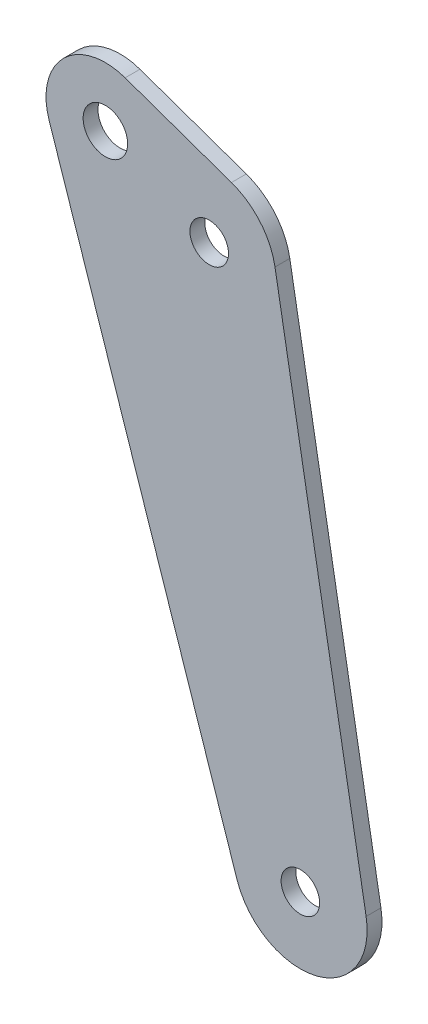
ISO-10303-21;
HEADER;
FILE_DESCRIPTION(('STEP AP214'),'2;1');
FILE_NAME('part.step','',(''),(''),'','','');
FILE_SCHEMA(('AUTOMOTIVE_DESIGN { 1 0 10303 214 1 1 1 1 }'));
ENDSEC;
DATA;
#1=APPLICATION_CONTEXT('core data for automotive mechanical design processes');
#2=APPLICATION_PROTOCOL_DEFINITION('international standard','automotive_design',2000,#1);
#3=PRODUCT_CONTEXT('',#1,'mechanical');
#4=PRODUCT('Part','Part','',(#3));
#5=PRODUCT_RELATED_PRODUCT_CATEGORY('part','',(#4));
#6=PRODUCT_DEFINITION_FORMATION('','',#4);
#7=PRODUCT_DEFINITION_CONTEXT('part definition',#1,'design');
#8=PRODUCT_DEFINITION('design','',#6,#7);
#9=PRODUCT_DEFINITION_SHAPE('','',#8);
#10=(LENGTH_UNIT() NAMED_UNIT(*) SI_UNIT(.MILLI.,.METRE.));
#11=(NAMED_UNIT(*) PLANE_ANGLE_UNIT() SI_UNIT($,.RADIAN.));
#12=(NAMED_UNIT(*) SI_UNIT($,.STERADIAN.) SOLID_ANGLE_UNIT());
#13=UNCERTAINTY_MEASURE_WITH_UNIT(LENGTH_MEASURE(1.E-05),#10,'distance_accuracy_value','');
#14=(GEOMETRIC_REPRESENTATION_CONTEXT(3) GLOBAL_UNCERTAINTY_ASSIGNED_CONTEXT((#13)) GLOBAL_UNIT_ASSIGNED_CONTEXT((#10,
#11,#12)) REPRESENTATION_CONTEXT('',''));
#15=CARTESIAN_POINT('',(0.,0.,0.));
#16=DIRECTION('',(0.,0.,1.));
#17=DIRECTION('',(1.,0.,0.));
#18=AXIS2_PLACEMENT_3D('',#15,#16,#17);
#19=CARTESIAN_POINT('',(-36.,-62.,6.2));
#20=DIRECTION('',(0.,0.,1.));
#21=DIRECTION('',(1.,0.,0.));
#22=AXIS2_PLACEMENT_3D('',#19,#20,#21);
#23=PLANE('',#22);
#24=CARTESIAN_POINT('',(-22.,-68.,6.2));
#25=DIRECTION('',(0.,0.,1.));
#26=DIRECTION('',(1.,0.,0.));
#27=AXIS2_PLACEMENT_3D('',#24,#25,#26);
#28=CIRCLE('',#27,2.60000000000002);
#29=CARTESIAN_POINT('',(-19.4,-68.,6.2));
#30=VERTEX_POINT('',#29);
#31=EDGE_CURVE('E187',#30,#30,#28,.T.);
#32=ORIENTED_EDGE('',*,*,#31,.F.);
#33=EDGE_LOOP('',(#32));
#34=FACE_BOUND('',#33,.T.);
#35=CARTESIAN_POINT('',(-36.,-62.,6.2));
#36=DIRECTION('',(0.,0.,1.));
#37=DIRECTION('',(1.,0.,0.));
#38=AXIS2_PLACEMENT_3D('',#35,#36,#37);
#39=CIRCLE('',#38,8.);
#40=CARTESIAN_POINT('',(-33.3382032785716,-54.4558076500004,6.2));
#41=VERTEX_POINT('',#40);
#42=CARTESIAN_POINT('',(-43.5892726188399,-64.5304033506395,6.2));
#43=VERTEX_POINT('',#42);
#44=EDGE_CURVE('E132',#41,#43,#39,.T.);
#45=ORIENTED_EDGE('',*,*,#44,.T.);
#46=DIRECTION('',(0.316300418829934,-0.948659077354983,0.));
#47=VECTOR('',#46,1.);
#48=CARTESIAN_POINT('',(-43.5892726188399,-64.5304033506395,6.2));
#49=LINE('',#48,#47);
#50=CARTESIAN_POINT('',(-18.2523231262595,-140.521852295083,6.2));
#51=VERTEX_POINT('',#50);
#52=EDGE_CURVE('E90',#43,#51,#49,.T.);
#53=ORIENTED_EDGE('',*,*,#52,.T.);
#54=CARTESIAN_POINT('',(-9.71439143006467,-137.675148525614,6.2));
#55=DIRECTION('',(0.,0.,1.));
#56=DIRECTION('',(1.,0.,0.));
#57=AXIS2_PLACEMENT_3D('',#54,#55,#56);
#58=CIRCLE('',#57,9.);
#59=CARTESIAN_POINT('',(-0.851121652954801,-136.112314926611,6.2));
#60=VERTEX_POINT('',#59);
#61=EDGE_CURVE('E103',#51,#60,#58,.T.);
#62=ORIENTED_EDGE('',*,*,#61,.T.);
#63=DIRECTION('',(-0.17364817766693,0.984807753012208,0.));
#64=VECTOR('',#63,1.);
#65=CARTESIAN_POINT('',(-0.851121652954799,-136.112314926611,6.2));
#66=LINE('',#65,#64);
#67=CARTESIAN_POINT('',(-13.1367302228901,-66.4371664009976,6.2));
#68=VERTEX_POINT('',#67);
#69=EDGE_CURVE('E97',#60,#68,#66,.T.);
#70=ORIENTED_EDGE('',*,*,#69,.T.);
#71=CARTESIAN_POINT('',(-22.,-68.,6.2));
#72=DIRECTION('',(0.,0.,1.));
#73=DIRECTION('',(1.,0.,0.));
#74=AXIS2_PLACEMENT_3D('',#71,#72,#73);
#75=CIRCLE('',#74,9.00000000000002);
#76=CARTESIAN_POINT('',(-19.005478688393,-59.5127836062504,6.2));
#77=VERTEX_POINT('',#76);
#78=EDGE_CURVE('E101',#68,#77,#75,.T.);
#79=ORIENTED_EDGE('',*,*,#78,.T.);
#80=DIRECTION('',(-0.943024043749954,0.332724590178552,0.));
#81=VECTOR('',#80,1.);
#82=CARTESIAN_POINT('',(-19.005478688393,-59.5127836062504,6.2));
#83=LINE('',#82,#81);
#84=EDGE_CURVE('E53',#77,#41,#83,.T.);
#85=ORIENTED_EDGE('',*,*,#84,.T.);
#86=EDGE_LOOP('',(#45,#53,#62,#70,#79,#85));
#87=FACE_BOUND('',#86,.T.);
#88=CARTESIAN_POINT('',(-36.,-62.,6.2));
#89=DIRECTION('',(0.,0.,1.));
#90=DIRECTION('',(1.,0.,0.));
#91=AXIS2_PLACEMENT_3D('',#88,#89,#90);
#92=CIRCLE('',#91,2.99999999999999);
#93=CARTESIAN_POINT('',(-33.,-62.,6.2));
#94=VERTEX_POINT('',#93);
#95=EDGE_CURVE('E125',#94,#94,#92,.T.);
#96=ORIENTED_EDGE('',*,*,#95,.F.);
#97=EDGE_LOOP('',(#96));
#98=FACE_BOUND('',#97,.T.);
#99=CARTESIAN_POINT('',(-9.71439143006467,-137.675148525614,6.2));
#100=DIRECTION('',(0.,0.,1.));
#101=DIRECTION('',(1.,0.,0.));
#102=AXIS2_PLACEMENT_3D('',#99,#100,#101);
#103=CIRCLE('',#102,2.6);
#104=CARTESIAN_POINT('',(-7.11439143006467,-137.675148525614,6.2));
#105=VERTEX_POINT('',#104);
#106=EDGE_CURVE('E178',#105,#105,#103,.T.);
#107=ORIENTED_EDGE('',*,*,#106,.F.);
#108=EDGE_LOOP('',(#107));
#109=FACE_BOUND('',#108,.T.);
#110=ADVANCED_FACE('F36',(#34,#87,#98,#109),#23,.T.);
#111=CARTESIAN_POINT('',(-36.,-62.,4.2));
#112=DIRECTION('',(0.,0.,1.));
#113=DIRECTION('',(1.,0.,0.));
#114=AXIS2_PLACEMENT_3D('',#111,#112,#113);
#115=PLANE('',#114);
#116=CARTESIAN_POINT('',(-36.,-62.,4.2));
#117=DIRECTION('',(0.,0.,1.));
#118=DIRECTION('',(1.,0.,0.));
#119=AXIS2_PLACEMENT_3D('',#116,#117,#118);
#120=CIRCLE('',#119,8.);
#121=CARTESIAN_POINT('',(-33.3382032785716,-54.4558076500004,4.2));
#122=VERTEX_POINT('',#121);
#123=CARTESIAN_POINT('',(-43.5892726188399,-64.5304033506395,4.2));
#124=VERTEX_POINT('',#123);
#125=EDGE_CURVE('E121',#122,#124,#120,.T.);
#126=ORIENTED_EDGE('',*,*,#125,.F.);
#127=DIRECTION('',(-0.943024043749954,0.332724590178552,0.));
#128=VECTOR('',#127,1.);
#129=CARTESIAN_POINT('',(-19.005478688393,-59.5127836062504,4.2));
#130=LINE('',#129,#128);
#131=CARTESIAN_POINT('',(-19.005478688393,-59.5127836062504,4.2));
#132=VERTEX_POINT('',#131);
#133=EDGE_CURVE('E82',#132,#122,#130,.T.);
#134=ORIENTED_EDGE('',*,*,#133,.F.);
#135=CARTESIAN_POINT('',(-22.,-68.,4.2));
#136=DIRECTION('',(0.,0.,1.));
#137=DIRECTION('',(1.,0.,0.));
#138=AXIS2_PLACEMENT_3D('',#135,#136,#137);
#139=CIRCLE('',#138,9.00000000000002);
#140=CARTESIAN_POINT('',(-13.1367302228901,-66.4371664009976,4.2));
#141=VERTEX_POINT('',#140);
#142=EDGE_CURVE('E76',#141,#132,#139,.T.);
#143=ORIENTED_EDGE('',*,*,#142,.F.);
#144=DIRECTION('',(-0.17364817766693,0.984807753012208,0.));
#145=VECTOR('',#144,1.);
#146=CARTESIAN_POINT('',(-0.851121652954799,-136.112314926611,4.2));
#147=LINE('',#146,#145);
#148=CARTESIAN_POINT('',(-0.851121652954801,-136.112314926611,4.2));
#149=VERTEX_POINT('',#148);
#150=EDGE_CURVE('E111',#149,#141,#147,.T.);
#151=ORIENTED_EDGE('',*,*,#150,.F.);
#152=CARTESIAN_POINT('',(-9.71439143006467,-137.675148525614,4.2));
#153=DIRECTION('',(0.,0.,1.));
#154=DIRECTION('',(1.,0.,0.));
#155=AXIS2_PLACEMENT_3D('',#152,#153,#154);
#156=CIRCLE('',#155,9.);
#157=CARTESIAN_POINT('',(-18.2523231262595,-140.521852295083,4.2));
#158=VERTEX_POINT('',#157);
#159=EDGE_CURVE('E127',#158,#149,#156,.T.);
#160=ORIENTED_EDGE('',*,*,#159,.F.);
#161=DIRECTION('',(0.316300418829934,-0.948659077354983,0.));
#162=VECTOR('',#161,1.);
#163=CARTESIAN_POINT('',(-43.5892726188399,-64.5304033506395,4.2));
#164=LINE('',#163,#162);
#165=EDGE_CURVE('E124',#124,#158,#164,.T.);
#166=ORIENTED_EDGE('',*,*,#165,.F.);
#167=EDGE_LOOP('',(#126,#134,#143,#151,#160,#166));
#168=FACE_BOUND('',#167,.T.);
#169=CARTESIAN_POINT('',(-36.,-62.,4.2));
#170=DIRECTION('',(0.,0.,1.));
#171=DIRECTION('',(1.,0.,0.));
#172=AXIS2_PLACEMENT_3D('',#169,#170,#171);
#173=CIRCLE('',#172,2.99999999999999);
#174=CARTESIAN_POINT('',(-33.,-62.,4.2));
#175=VERTEX_POINT('',#174);
#176=EDGE_CURVE('E190',#175,#175,#173,.T.);
#177=ORIENTED_EDGE('',*,*,#176,.T.);
#178=EDGE_LOOP('',(#177));
#179=FACE_BOUND('',#178,.T.);
#180=CARTESIAN_POINT('',(-22.,-68.,4.2));
#181=DIRECTION('',(0.,0.,1.));
#182=DIRECTION('',(1.,0.,0.));
#183=AXIS2_PLACEMENT_3D('',#180,#181,#182);
#184=CIRCLE('',#183,2.60000000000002);
#185=CARTESIAN_POINT('',(-19.4,-68.,4.2));
#186=VERTEX_POINT('',#185);
#187=EDGE_CURVE('E184',#186,#186,#184,.T.);
#188=ORIENTED_EDGE('',*,*,#187,.T.);
#189=EDGE_LOOP('',(#188));
#190=FACE_BOUND('',#189,.T.);
#191=CARTESIAN_POINT('',(-9.71439143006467,-137.675148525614,4.2));
#192=DIRECTION('',(0.,0.,1.));
#193=DIRECTION('',(1.,0.,0.));
#194=AXIS2_PLACEMENT_3D('',#191,#192,#193);
#195=CIRCLE('',#194,2.6);
#196=CARTESIAN_POINT('',(-7.11439143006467,-137.675148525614,4.2));
#197=VERTEX_POINT('',#196);
#198=EDGE_CURVE('E181',#197,#197,#195,.T.);
#199=ORIENTED_EDGE('',*,*,#198,.T.);
#200=EDGE_LOOP('',(#199));
#201=FACE_BOUND('',#200,.T.);
#202=ADVANCED_FACE('F141',(#168,#179,#190,#201),#115,.F.);
#203=CARTESIAN_POINT('',(-36.,-62.,6.2));
#204=DIRECTION('',(0.,0.,-1.));
#205=DIRECTION('',(-1.,0.,0.));
#206=AXIS2_PLACEMENT_3D('',#203,#204,#205);
#207=CYLINDRICAL_SURFACE('',#206,8.);
#208=ORIENTED_EDGE('',*,*,#125,.T.);
#209=DIRECTION('',(0.,0.,-1.));
#210=VECTOR('',#209,1.);
#211=CARTESIAN_POINT('',(-43.5892726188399,-64.5304033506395,6.2));
#212=LINE('',#211,#210);
#213=EDGE_CURVE('E11',#43,#124,#212,.T.);
#214=ORIENTED_EDGE('',*,*,#213,.F.);
#215=ORIENTED_EDGE('',*,*,#44,.F.);
#216=DIRECTION('',(0.,0.,-1.));
#217=VECTOR('',#216,1.);
#218=CARTESIAN_POINT('',(-33.3382032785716,-54.4558076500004,6.2));
#219=LINE('',#218,#217);
#220=EDGE_CURVE('E117',#41,#122,#219,.T.);
#221=ORIENTED_EDGE('',*,*,#220,.T.);
#222=EDGE_LOOP('',(#208,#214,#215,#221));
#223=FACE_BOUND('',#222,.T.);
#224=ADVANCED_FACE('F38',(#223),#207,.T.);
#225=CARTESIAN_POINT('',(-43.5892726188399,-64.5304033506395,6.2));
#226=DIRECTION('',(0.948659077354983,0.316300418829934,0.));
#227=DIRECTION('',(-0.316300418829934,0.948659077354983,0.));
#228=AXIS2_PLACEMENT_3D('',#225,#226,#227);
#229=PLANE('',#228);
#230=ORIENTED_EDGE('',*,*,#165,.T.);
#231=DIRECTION('',(0.,0.,-1.));
#232=VECTOR('',#231,1.);
#233=CARTESIAN_POINT('',(-18.2523231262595,-140.521852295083,6.2));
#234=LINE('',#233,#232);
#235=EDGE_CURVE('E45',#51,#158,#234,.T.);
#236=ORIENTED_EDGE('',*,*,#235,.F.);
#237=ORIENTED_EDGE('',*,*,#52,.F.);
#238=ORIENTED_EDGE('',*,*,#213,.T.);
#239=EDGE_LOOP('',(#230,#236,#237,#238));
#240=FACE_BOUND('',#239,.T.);
#241=ADVANCED_FACE('F240',(#240),#229,.F.);
#242=CARTESIAN_POINT('',(-9.71439143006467,-137.675148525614,6.2));
#243=DIRECTION('',(0.,0.,-1.));
#244=DIRECTION('',(-1.,0.,0.));
#245=AXIS2_PLACEMENT_3D('',#242,#243,#244);
#246=CYLINDRICAL_SURFACE('',#245,9.);
#247=ORIENTED_EDGE('',*,*,#159,.T.);
#248=DIRECTION('',(0.,0.,-1.));
#249=VECTOR('',#248,1.);
#250=CARTESIAN_POINT('',(-0.851121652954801,-136.112314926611,6.2));
#251=LINE('',#250,#249);
#252=EDGE_CURVE('E112',#60,#149,#251,.T.);
#253=ORIENTED_EDGE('',*,*,#252,.F.);
#254=ORIENTED_EDGE('',*,*,#61,.F.);
#255=ORIENTED_EDGE('',*,*,#235,.T.);
#256=EDGE_LOOP('',(#247,#253,#254,#255));
#257=FACE_BOUND('',#256,.T.);
#258=ADVANCED_FACE('F138',(#257),#246,.T.);
#259=CARTESIAN_POINT('',(-0.851121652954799,-136.112314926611,6.2));
#260=DIRECTION('',(-0.984807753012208,-0.17364817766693,0.));
#261=DIRECTION('',(0.17364817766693,-0.984807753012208,0.));
#262=AXIS2_PLACEMENT_3D('',#259,#260,#261);
#263=PLANE('',#262);
#264=ORIENTED_EDGE('',*,*,#150,.T.);
#265=DIRECTION('',(0.,0.,-1.));
#266=VECTOR('',#265,1.);
#267=CARTESIAN_POINT('',(-13.1367302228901,-66.4371664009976,6.2));
#268=LINE('',#267,#266);
#269=EDGE_CURVE('E108',#68,#141,#268,.T.);
#270=ORIENTED_EDGE('',*,*,#269,.F.);
#271=ORIENTED_EDGE('',*,*,#69,.F.);
#272=ORIENTED_EDGE('',*,*,#252,.T.);
#273=EDGE_LOOP('',(#264,#270,#271,#272));
#274=FACE_BOUND('',#273,.T.);
#275=ADVANCED_FACE('F109',(#274),#263,.F.);
#276=CARTESIAN_POINT('',(-22.,-68.,6.2));
#277=DIRECTION('',(0.,0.,-1.));
#278=DIRECTION('',(-1.,0.,0.));
#279=AXIS2_PLACEMENT_3D('',#276,#277,#278);
#280=CYLINDRICAL_SURFACE('',#279,9.00000000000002);
#281=ORIENTED_EDGE('',*,*,#142,.T.);
#282=DIRECTION('',(0.,0.,-1.));
#283=VECTOR('',#282,1.);
#284=CARTESIAN_POINT('',(-19.005478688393,-59.5127836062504,6.2));
#285=LINE('',#284,#283);
#286=EDGE_CURVE('E113',#77,#132,#285,.T.);
#287=ORIENTED_EDGE('',*,*,#286,.F.);
#288=ORIENTED_EDGE('',*,*,#78,.F.);
#289=ORIENTED_EDGE('',*,*,#269,.T.);
#290=EDGE_LOOP('',(#281,#287,#288,#289));
#291=FACE_BOUND('',#290,.T.);
#292=ADVANCED_FACE('F115',(#291),#280,.T.);
#293=CARTESIAN_POINT('',(-19.005478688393,-59.5127836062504,6.2));
#294=DIRECTION('',(-0.332724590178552,-0.943024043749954,0.));
#295=DIRECTION('',(0.943024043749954,-0.332724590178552,0.));
#296=AXIS2_PLACEMENT_3D('',#293,#294,#295);
#297=PLANE('',#296);
#298=ORIENTED_EDGE('',*,*,#133,.T.);
#299=ORIENTED_EDGE('',*,*,#220,.F.);
#300=ORIENTED_EDGE('',*,*,#84,.F.);
#301=ORIENTED_EDGE('',*,*,#286,.T.);
#302=EDGE_LOOP('',(#298,#299,#300,#301));
#303=FACE_BOUND('',#302,.T.);
#304=ADVANCED_FACE('F146',(#303),#297,.F.);
#305=CARTESIAN_POINT('',(-36.,-62.,6.2));
#306=DIRECTION('',(0.,0.,-1.));
#307=DIRECTION('',(-1.,0.,0.));
#308=AXIS2_PLACEMENT_3D('',#305,#306,#307);
#309=CYLINDRICAL_SURFACE('',#308,2.99999999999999);
#310=ORIENTED_EDGE('',*,*,#95,.T.);
#311=EDGE_LOOP('',(#310));
#312=FACE_BOUND('',#311,.T.);
#313=ORIENTED_EDGE('',*,*,#176,.F.);
#314=EDGE_LOOP('',(#313));
#315=FACE_BOUND('',#314,.T.);
#316=ADVANCED_FACE('F148',(#312,#315),#309,.F.);
#317=CARTESIAN_POINT('',(-22.,-68.,6.2));
#318=DIRECTION('',(0.,0.,-1.));
#319=DIRECTION('',(-1.,0.,0.));
#320=AXIS2_PLACEMENT_3D('',#317,#318,#319);
#321=CYLINDRICAL_SURFACE('',#320,2.60000000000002);
#322=ORIENTED_EDGE('',*,*,#31,.T.);
#323=EDGE_LOOP('',(#322));
#324=FACE_BOUND('',#323,.T.);
#325=ORIENTED_EDGE('',*,*,#187,.F.);
#326=EDGE_LOOP('',(#325));
#327=FACE_BOUND('',#326,.T.);
#328=ADVANCED_FACE('F154',(#324,#327),#321,.F.);
#329=CARTESIAN_POINT('',(-9.71439143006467,-137.675148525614,6.2));
#330=DIRECTION('',(0.,0.,-1.));
#331=DIRECTION('',(-1.,0.,0.));
#332=AXIS2_PLACEMENT_3D('',#329,#330,#331);
#333=CYLINDRICAL_SURFACE('',#332,2.6);
#334=ORIENTED_EDGE('',*,*,#106,.T.);
#335=EDGE_LOOP('',(#334));
#336=FACE_BOUND('',#335,.T.);
#337=ORIENTED_EDGE('',*,*,#198,.F.);
#338=EDGE_LOOP('',(#337));
#339=FACE_BOUND('',#338,.T.);
#340=ADVANCED_FACE('F169',(#336,#339),#333,.F.);
#341=CLOSED_SHELL('',(#110,#202,#224,#241,#258,#275,#292,#304,#316,#328,#340));
#342=MANIFOLD_SOLID_BREP('B2',#341);
#343=ADVANCED_BREP_SHAPE_REPRESENTATION('',(#18,#342),#14);
#344=SHAPE_DEFINITION_REPRESENTATION(#9,#343);
ENDSEC;
END-ISO-10303-21;
